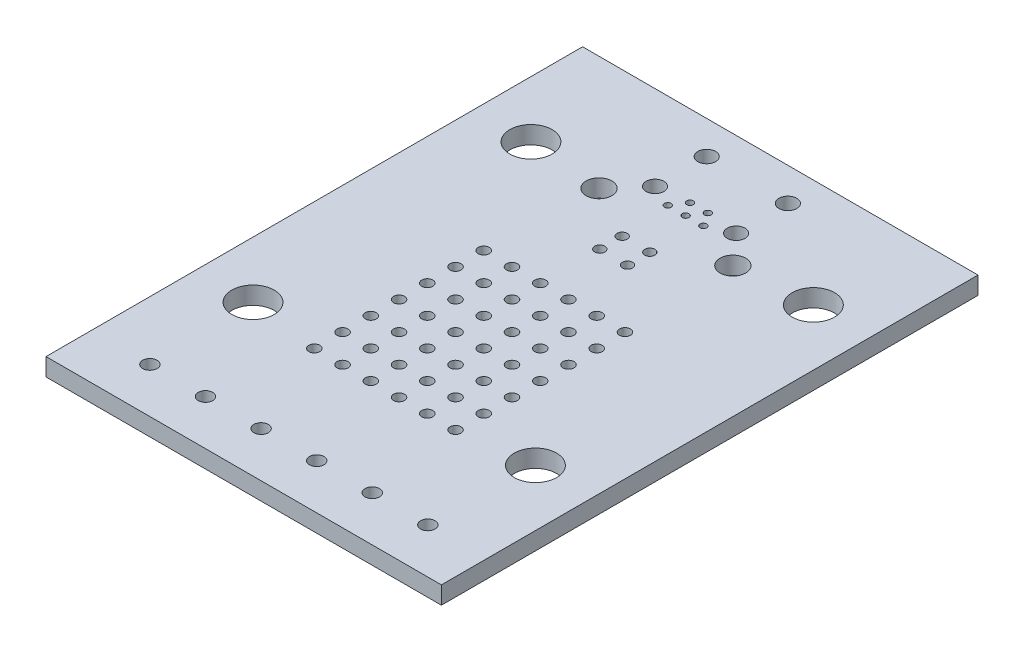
from build123d import *

# Parameters (mm, degrees)
SKETCH1_W           = 35.56
SKETCH1_H           = 48.26
BOSS_EXTRUDE1_DEPTH = 1.5875
SKETCH2_R           = 1.905
SKETCH2_R_2         = 0.65
CUT_EXTRUDE1_DEPTH  = 52.455574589
SKETCH3_R           = 0.4953
CUT_EXTRUDE2_DEPTH  = 52.455574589
SKETCH4_R           = 0.4572
SKETCH4_R_2         = 1.1557
SKETCH4_R_3         = 0.8
SKETCH4_R_4         = 0.3
CUT_EXTRUDE3_DEPTH  = 52.455574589


with BuildPart() as part:
    # Sketch1 → Boss-Extrude1 (new body)
    with BuildSketch(Plane(origin=(0, 0, 0), x_dir=(1, 0, 0), z_dir=(0, 1, 0))):
        with Locations((0, 24.13)):
            Rectangle(SKETCH1_W, SKETCH1_H)
    extrude(amount=BOSS_EXTRUDE1_DEPTH)

    # Sketch2 (on Top Plane) → Cut-Extrude1 (cut, through all)
    with BuildSketch(Plane(origin=(0, 0, 0), x_dir=(1, 0, 0), z_dir=(0, 1, 0))):
        with Locations(Location((-12.7, 13.5382, 0), (0, 0, 270))):
            Circle(SKETCH2_R)
        with Locations(Location((-12.7, 38.53434, 0), (0, 0, 270))):
            Circle(SKETCH2_R)
        with Locations(Location((-12.49934, 4.064, 0), (0, 0, 270))):
            Circle(SKETCH2_R_2)
        with Locations(Location((-7.50062, 4.064, 0), (0, 0, 270))):
            Circle(SKETCH2_R_2)
        with Locations(Location((-2.49936, 4.064, 0), (0, 0, 270))):
            Circle(SKETCH2_R_2)
        with Locations(Location((12.7, 38.53434, 0), (0, 0, 90))):
            Circle(SKETCH2_R)
        with Locations(Location((12.7, 13.5382, 0), (0, 0, 90))):
            Circle(SKETCH2_R)
        with Locations(Location((2.49936, 4.064, 0), (0, 0, 90))):
            Circle(SKETCH2_R_2)
        with Locations(Location((7.50062, 4.064, 0), (0, 0, 90))):
            Circle(SKETCH2_R_2)
        with Locations(Location((12.49934, 4.064, 0), (0, 0, 90))):
            Circle(SKETCH2_R_2)
    extrude(amount=CUT_EXTRUDE1_DEPTH, mode=Mode.SUBTRACT)

    # Sketch3 → Cut-Extrude2 (cut, through all)
    with BuildSketch(Plane(origin=(0, 1.5875, 0), x_dir=(1, 0, 0), z_dir=(0, 1, 0))):
        with Locations(Location((-6.35, 12.7, 0), (0, 0, 270))):
            Circle(SKETCH3_R)
        with Locations(Location((-3.81, 12.7, 0), (0, 0, 270))):
            Circle(SKETCH3_R)
        with Locations(Location((-1.27, 12.7, 0), (0, 0, 270))):
            Circle(SKETCH3_R)
        with Locations(Location((1.27, 12.7, 0), (0, 0, 270))):
            Circle(SKETCH3_R)
        with Locations(Location((3.81, 12.7, 0), (0, 0, 270))):
            Circle(SKETCH3_R)
        with Locations(Location((6.35, 12.7, 0), (0, 0, 270))):
            Circle(SKETCH3_R)
        with Locations(Location((-3.81, 15.24, 0), (0, 0, 270))):
            Circle(SKETCH3_R)
        with Locations(Location((-1.27, 15.24, 0), (0, 0, 270))):
            Circle(SKETCH3_R)
        with Locations(Location((1.27, 15.24, 0), (0, 0, 270))):
            Circle(SKETCH3_R)
        with Locations(Location((3.81, 15.24, 0), (0, 0, 270))):
            Circle(SKETCH3_R)
        with Locations(Location((6.35, 15.24, 0), (0, 0, 270))):
            Circle(SKETCH3_R)
        with Locations(Location((-3.81, 17.78, 0), (0, 0, 270))):
            Circle(SKETCH3_R)
        with Locations(Location((-1.27, 17.78, 0), (0, 0, 270))):
            Circle(SKETCH3_R)
        with Locations(Location((1.27, 17.78, 0), (0, 0, 270))):
            Circle(SKETCH3_R)
        with Locations(Location((3.81, 17.78, 0), (0, 0, 270))):
            Circle(SKETCH3_R)
        with Locations(Location((6.35, 17.78, 0), (0, 0, 270))):
            Circle(SKETCH3_R)
        with Locations(Location((-3.81, 20.32, 0), (0, 0, 270))):
            Circle(SKETCH3_R)
        with Locations(Location((-1.27, 20.32, 0), (0, 0, 270))):
            Circle(SKETCH3_R)
        with Locations(Location((1.27, 20.32, 0), (0, 0, 270))):
            Circle(SKETCH3_R)
        with Locations(Location((3.81, 20.32, 0), (0, 0, 270))):
            Circle(SKETCH3_R)
        with Locations(Location((6.35, 20.32, 0), (0, 0, 270))):
            Circle(SKETCH3_R)
        with Locations(Location((-3.81, 22.86, 0), (0, 0, 270))):
            Circle(SKETCH3_R)
        with Locations(Location((-1.27, 22.86, 0), (0, 0, 270))):
            Circle(SKETCH3_R)
        with Locations(Location((1.27, 22.86, 0), (0, 0, 270))):
            Circle(SKETCH3_R)
        with Locations(Location((3.81, 22.86, 0), (0, 0, 270))):
            Circle(SKETCH3_R)
        with Locations(Location((6.35, 22.86, 0), (0, 0, 270))):
            Circle(SKETCH3_R)
        with Locations(Location((-3.81, 25.4, 0), (0, 0, 270))):
            Circle(SKETCH3_R)
        with Locations(Location((-1.27, 25.4, 0), (0, 0, 270))):
            Circle(SKETCH3_R)
        with Locations(Location((1.27, 25.4, 0), (0, 0, 270))):
            Circle(SKETCH3_R)
        with Locations(Location((3.81, 25.4, 0), (0, 0, 270))):
            Circle(SKETCH3_R)
        with Locations(Location((6.35, 25.4, 0), (0, 0, 270))):
            Circle(SKETCH3_R)
        with Locations(Location((-3.81, 27.94, 0), (0, 0, 270))):
            Circle(SKETCH3_R)
        with Locations(Location((-1.27, 27.94, 0), (0, 0, 270))):
            Circle(SKETCH3_R)
        with Locations(Location((1.27, 27.94, 0), (0, 0, 270))):
            Circle(SKETCH3_R)
        with Locations(Location((3.81, 27.94, 0), (0, 0, 270))):
            Circle(SKETCH3_R)
        with Locations(Location((6.35, 27.94, 0), (0, 0, 270))):
            Circle(SKETCH3_R)
        with Locations(Location((-6.35, 15.24, 0), (0, 0, 270))):
            Circle(SKETCH3_R)
        with Locations(Location((-6.35, 17.78, 0), (0, 0, 270))):
            Circle(SKETCH3_R)
        with Locations(Location((-6.35, 20.32, 0), (0, 0, 270))):
            Circle(SKETCH3_R)
        with Locations(Location((-6.35, 22.86, 0), (0, 0, 270))):
            Circle(SKETCH3_R)
        with Locations(Location((-6.35, 25.4, 0), (0, 0, 270))):
            Circle(SKETCH3_R)
        with Locations(Location((-6.35, 27.94, 0), (0, 0, 270))):
            Circle(SKETCH3_R)
    extrude(amount=-CUT_EXTRUDE2_DEPTH, mode=Mode.SUBTRACT)

    # Sketch4 → Cut-Extrude3 (cut, through all)
    with BuildSketch(Plane(origin=(0, 1.5875, 0), x_dir=(1, 0, 0), z_dir=(0, 1, 0))):
        with Locations(Location((-1.2446, 33.274, 0), (0, 0, 270))):
            Circle(SKETCH4_R)
        with Locations(Location((-1.2446, 35.2806, 0), (0, 0, 270))):
            Circle(SKETCH4_R)
        with Locations(Location((-6.0198, 37.973, 0), (0, 0, 270))):
            Circle(SKETCH4_R_2)
        with Locations(Location((1.2446, 33.274, 0), (0, 0, 90))):
            Circle(SKETCH4_R)
        with Locations(Location((1.2446, 35.2806, 0), (0, 0, 90))):
            Circle(SKETCH4_R)
        with Locations(Location((6.0198, 37.973, 0), (0, 0, 90))):
            Circle(SKETCH4_R_2)
        with Locations(Location((-3.64998, 40.64, 0), (0, 0, 270))):
            Circle(SKETCH4_R_3)
        with Locations(Location((-3.64998, 45.29074, 0), (0, 0, 270))):
            Circle(SKETCH4_R_3)
        with Locations(Location((-1.6002, 39.74084, 0), (0, 0, 270))):
            Circle(SKETCH4_R_4)
        with Locations(Location((0, 39.74084, 0), (0, 0, 270))):
            Circle(SKETCH4_R_4)
        with Locations(Location((-0.8001, 40.93972, 0), (0, 0, 270))):
            Circle(SKETCH4_R_4)
        with Locations(Location((3.64998, 45.29074, 0), (0, 0, 90))):
            Circle(SKETCH4_R_3)
        with Locations(Location((3.64998, 40.64, 0), (0, 0, 90))):
            Circle(SKETCH4_R_3)
        with Locations(Location((0.8001, 40.93972, 0), (0, 0, 90))):
            Circle(SKETCH4_R_4)
        with Locations(Location((1.6002, 39.74084, 0), (0, 0, 90))):
            Circle(SKETCH4_R_4)
    extrude(amount=-CUT_EXTRUDE3_DEPTH, mode=Mode.SUBTRACT)


solid = part.part
